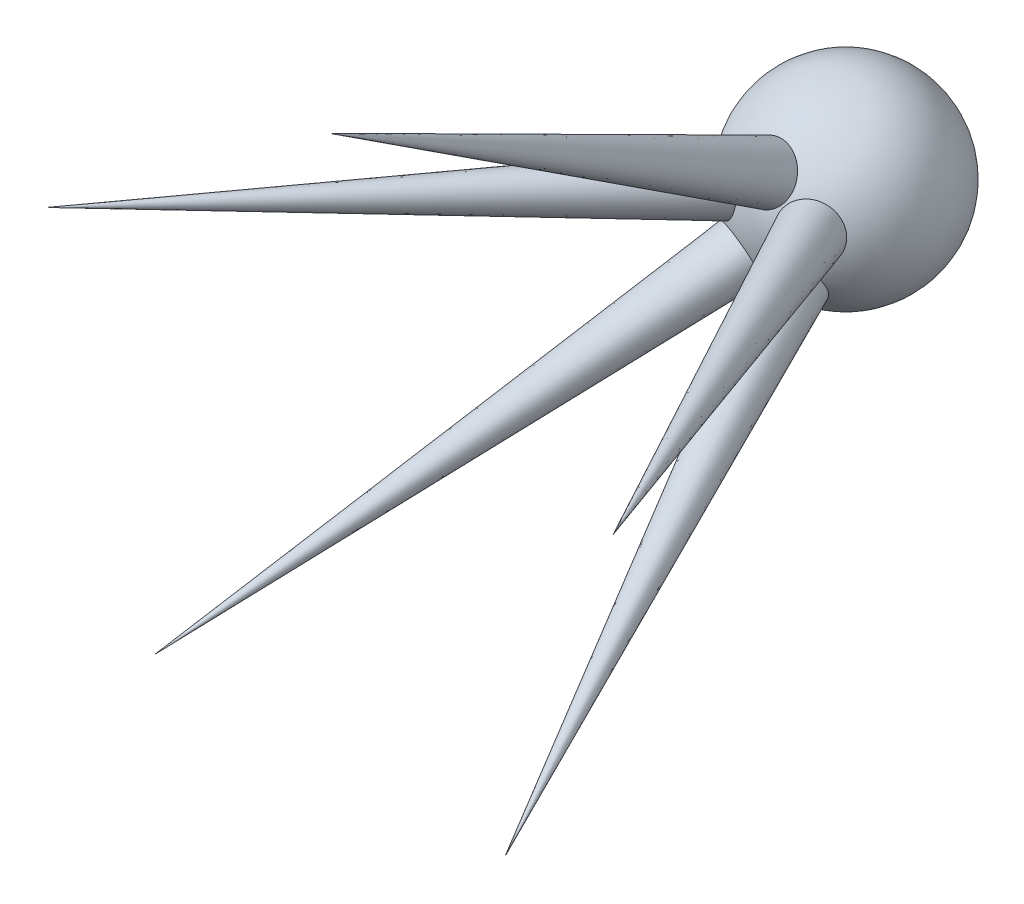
ISO-10303-21;
HEADER;
FILE_DESCRIPTION(('STEP AP214'),'2;1');
FILE_NAME('part.step','',(''),(''),'','','');
FILE_SCHEMA(('AUTOMOTIVE_DESIGN { 1 0 10303 214 1 1 1 1 }'));
ENDSEC;
DATA;
#1=APPLICATION_CONTEXT('core data for automotive mechanical design processes');
#2=APPLICATION_PROTOCOL_DEFINITION('international standard','automotive_design',2000,#1);
#3=PRODUCT_CONTEXT('',#1,'mechanical');
#4=PRODUCT('Part','Part','',(#3));
#5=PRODUCT_RELATED_PRODUCT_CATEGORY('part','',(#4));
#6=PRODUCT_DEFINITION_FORMATION('','',#4);
#7=PRODUCT_DEFINITION_CONTEXT('part definition',#1,'design');
#8=PRODUCT_DEFINITION('design','',#6,#7);
#9=PRODUCT_DEFINITION_SHAPE('','',#8);
#10=(LENGTH_UNIT() NAMED_UNIT(*) SI_UNIT(.MILLI.,.METRE.));
#11=(NAMED_UNIT(*) PLANE_ANGLE_UNIT() SI_UNIT($,.RADIAN.));
#12=(NAMED_UNIT(*) SI_UNIT($,.STERADIAN.) SOLID_ANGLE_UNIT());
#13=UNCERTAINTY_MEASURE_WITH_UNIT(LENGTH_MEASURE(1.E-05),#10,'distance_accuracy_value','');
#14=(GEOMETRIC_REPRESENTATION_CONTEXT(3) GLOBAL_UNCERTAINTY_ASSIGNED_CONTEXT((#13)) GLOBAL_UNIT_ASSIGNED_CONTEXT((#10,
#11,#12)) REPRESENTATION_CONTEXT('',''));
#15=CARTESIAN_POINT('',(0.,0.,0.));
#16=DIRECTION('',(0.,0.,1.));
#17=DIRECTION('',(1.,0.,0.));
#18=AXIS2_PLACEMENT_3D('',#15,#16,#17);
#19=CARTESIAN_POINT('',(0.,28.3666903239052,38.1116530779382));
#20=DIRECTION('',(0.,1.,0.));
#21=DIRECTION('',(0.,0.,1.));
#22=AXIS2_PLACEMENT_3D('',#19,#20,#21);
#23=SPHERICAL_SURFACE('',#22,1.5);
#24=CARTESIAN_POINT('',(0.684118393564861,28.5889738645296,39.3575599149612));
#25=DIRECTION('',(-0.475528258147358,-0.154508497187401,-0.866025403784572));
#26=DIRECTION('',(-0.876551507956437,0.,0.481308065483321));
#27=AXIS2_PLACEMENT_3D('',#24,#25,#26);
#28=CIRCLE('',#27,0.424603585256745);
#29=CARTESIAN_POINT('',(0.311931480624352,28.5889738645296,39.5619250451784));
#30=VERTEX_POINT('',#29);
#31=EDGE_CURVE('E100',#30,#30,#28,.T.);
#32=ORIENTED_EDGE('',*,*,#31,.T.);
#33=EDGE_LOOP('',(#32));
#34=FACE_BOUND('',#33,.T.);
#35=CARTESIAN_POINT('',(0.422808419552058,27.7847444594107,39.3575599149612));
#36=DIRECTION('',(-0.293892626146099,0.404508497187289,-0.866025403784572));
#37=DIRECTION('',(0.,0.90603742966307,0.423197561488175));
#38=AXIS2_PLACEMENT_3D('',#35,#36,#37);
#39=CIRCLE('',#38,0.424603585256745);
#40=CARTESIAN_POINT('',(0.422808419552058,28.1694512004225,39.537251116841));
#41=VERTEX_POINT('',#40);
#42=EDGE_CURVE('E95',#41,#41,#39,.F.);
#43=ORIENTED_EDGE('',*,*,#42,.F.);
#44=EDGE_LOOP('',(#43));
#45=FACE_BOUND('',#44,.T.);
#46=CARTESIAN_POINT('',(-0.422808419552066,27.7847444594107,39.3575599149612));
#47=DIRECTION('',(0.293892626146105,0.404508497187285,-0.866025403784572));
#48=DIRECTION('',(0.,0.906037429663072,0.423197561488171));
#49=AXIS2_PLACEMENT_3D('',#46,#47,#48);
#50=CIRCLE('',#49,0.424603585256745);
#51=CARTESIAN_POINT('',(-0.422808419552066,28.1694512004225,39.537251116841));
#52=VERTEX_POINT('',#51);
#53=EDGE_CURVE('E93',#52,#52,#50,.F.);
#54=ORIENTED_EDGE('',*,*,#53,.F.);
#55=EDGE_LOOP('',(#54));
#56=FACE_BOUND('',#55,.T.);
#57=CARTESIAN_POINT('',(-0.684118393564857,28.5889738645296,39.3575599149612));
#58=DIRECTION('',(0.475528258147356,-0.154508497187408,-0.866025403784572));
#59=DIRECTION('',(-0.876551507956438,0.,-0.48130806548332));
#60=AXIS2_PLACEMENT_3D('',#57,#58,#59);
#61=CIRCLE('',#60,0.424603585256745);
#62=CARTESIAN_POINT('',(-1.05630530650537,28.5889738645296,39.153194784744));
#63=VERTEX_POINT('',#62);
#64=EDGE_CURVE('E47',#63,#63,#61,.F.);
#65=ORIENTED_EDGE('',*,*,#64,.F.);
#66=EDGE_LOOP('',(#65));
#67=FACE_BOUND('',#66,.T.);
#68=CARTESIAN_POINT('',(0.,29.0860149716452,39.3575599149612));
#69=DIRECTION('',(0.,-0.49999999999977,-0.866025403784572));
#70=DIRECTION('',(0.,0.866025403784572,-0.49999999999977));
#71=AXIS2_PLACEMENT_3D('',#68,#69,#70);
#72=CIRCLE('',#71,0.424603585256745);
#73=CARTESIAN_POINT('',(0.,29.4537324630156,39.1452581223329));
#74=VERTEX_POINT('',#73);
#75=EDGE_CURVE('E11',#74,#74,#72,.F.);
#76=ORIENTED_EDGE('',*,*,#75,.F.);
#77=EDGE_LOOP('',(#76));
#78=FACE_BOUND('',#77,.T.);
#79=ADVANCED_FACE('F39',(#34,#45,#56,#67,#78),#23,.T.);
#80=CARTESIAN_POINT('',(0.,28.3666903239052,38.1116530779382));
#81=DIRECTION('',(-0.475528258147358,-0.154508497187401,-0.866025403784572));
#82=DIRECTION('',(0.309016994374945,-0.951056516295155,0.));
#83=AXIS2_PLACEMENT_3D('',#80,#81,#82);
#84=CONICAL_SURFACE('',#83,0.5,0.05235987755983);
#85=CARTESIAN_POINT('',(4.53680984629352,29.8407892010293,46.3740276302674));
#86=VERTEX_POINT('',#85);
#87=VERTEX_LOOP('',#86);
#88=FACE_BOUND('',#87,.T.);
#89=ORIENTED_EDGE('',*,*,#31,.F.);
#90=EDGE_LOOP('',(#89));
#91=FACE_BOUND('',#90,.T.);
#92=ADVANCED_FACE('F41',(#88,#91),#84,.T.);
#93=CARTESIAN_POINT('',(0.,28.3666903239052,38.1116530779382));
#94=DIRECTION('',(-0.293892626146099,0.404508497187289,-0.866025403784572));
#95=DIRECTION('',(-0.809016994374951,-0.587785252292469,0.));
#96=AXIS2_PLACEMENT_3D('',#93,#94,#95);
#97=CONICAL_SURFACE('',#96,0.5,0.05235987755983);
#98=CARTESIAN_POINT('',(2.80390268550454,24.5074493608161,46.3740276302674));
#99=VERTEX_POINT('',#98);
#100=VERTEX_LOOP('',#99);
#101=FACE_BOUND('',#100,.T.);
#102=ORIENTED_EDGE('',*,*,#42,.T.);
#103=EDGE_LOOP('',(#102));
#104=FACE_BOUND('',#103,.T.);
#105=ADVANCED_FACE('F75',(#101,#104),#97,.T.);
#106=CARTESIAN_POINT('',(0.,28.3666903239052,38.1116530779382));
#107=DIRECTION('',(0.293892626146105,0.404508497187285,-0.866025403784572));
#108=DIRECTION('',(-0.809016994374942,0.58778525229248,0.));
#109=AXIS2_PLACEMENT_3D('',#106,#107,#108);
#110=CONICAL_SURFACE('',#109,0.5,0.05235987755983);
#111=CARTESIAN_POINT('',(-2.80390268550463,24.5074493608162,46.3740276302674));
#112=VERTEX_POINT('',#111);
#113=VERTEX_LOOP('',#112);
#114=FACE_BOUND('',#113,.T.);
#115=ORIENTED_EDGE('',*,*,#53,.T.);
#116=EDGE_LOOP('',(#115));
#117=FACE_BOUND('',#116,.T.);
#118=ADVANCED_FACE('F81',(#114,#117),#110,.T.);
#119=CARTESIAN_POINT('',(0.,28.3666903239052,38.1116530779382));
#120=DIRECTION('',(0.475528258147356,-0.154508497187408,-0.866025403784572));
#121=DIRECTION('',(0.309016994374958,0.95105651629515,0.));
#122=AXIS2_PLACEMENT_3D('',#119,#120,#121);
#123=CONICAL_SURFACE('',#122,0.5,0.05235987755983);
#124=CARTESIAN_POINT('',(-4.53680984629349,29.8407892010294,46.3740276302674));
#125=VERTEX_POINT('',#124);
#126=VERTEX_LOOP('',#125);
#127=FACE_BOUND('',#126,.T.);
#128=ORIENTED_EDGE('',*,*,#64,.T.);
#129=EDGE_LOOP('',(#128));
#130=FACE_BOUND('',#129,.T.);
#131=ADVANCED_FACE('F66',(#127,#130),#123,.T.);
#132=CARTESIAN_POINT('',(0.,28.3666903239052,38.1116530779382));
#133=DIRECTION('',(0.,-0.49999999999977,-0.866025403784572));
#134=DIRECTION('',(1.,0.,0.));
#135=AXIS2_PLACEMENT_3D('',#132,#133,#134);
#136=CONICAL_SURFACE('',#135,0.5,0.05235987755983);
#137=CARTESIAN_POINT('',(0.,33.136974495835,46.3740276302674));
#138=VERTEX_POINT('',#137);
#139=VERTEX_LOOP('',#138);
#140=FACE_BOUND('',#139,.T.);
#141=ORIENTED_EDGE('',*,*,#75,.T.);
#142=EDGE_LOOP('',(#141));
#143=FACE_BOUND('',#142,.T.);
#144=ADVANCED_FACE('F63',(#140,#143),#136,.T.);
#145=CLOSED_SHELL('',(#79,#92,#105,#118,#131,#144));
#146=MANIFOLD_SOLID_BREP('B2',#145);
#147=ADVANCED_BREP_SHAPE_REPRESENTATION('',(#18,#146),#14);
#148=SHAPE_DEFINITION_REPRESENTATION(#9,#147);
ENDSEC;
END-ISO-10303-21;
